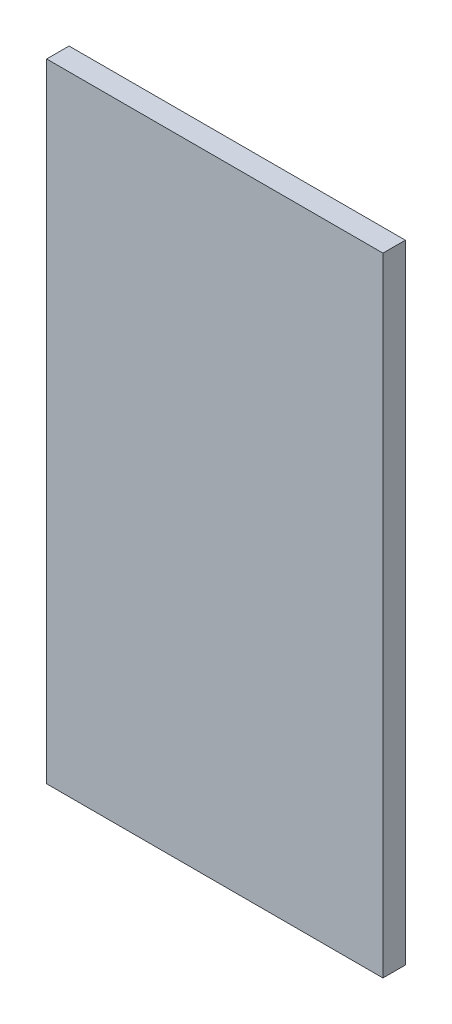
ISO-10303-21;
HEADER;
FILE_DESCRIPTION(('STEP AP214'),'2;1');
FILE_NAME('part.step','',(''),(''),'','','');
FILE_SCHEMA(('AUTOMOTIVE_DESIGN { 1 0 10303 214 1 1 1 1 }'));
ENDSEC;
DATA;
#1=APPLICATION_CONTEXT('core data for automotive mechanical design processes');
#2=APPLICATION_PROTOCOL_DEFINITION('international standard','automotive_design',2000,#1);
#3=PRODUCT_CONTEXT('',#1,'mechanical');
#4=PRODUCT('Part','Part','',(#3));
#5=PRODUCT_RELATED_PRODUCT_CATEGORY('part','',(#4));
#6=PRODUCT_DEFINITION_FORMATION('','',#4);
#7=PRODUCT_DEFINITION_CONTEXT('part definition',#1,'design');
#8=PRODUCT_DEFINITION('design','',#6,#7);
#9=PRODUCT_DEFINITION_SHAPE('','',#8);
#10=(LENGTH_UNIT() NAMED_UNIT(*) SI_UNIT(.MILLI.,.METRE.));
#11=(NAMED_UNIT(*) PLANE_ANGLE_UNIT() SI_UNIT($,.RADIAN.));
#12=(NAMED_UNIT(*) SI_UNIT($,.STERADIAN.) SOLID_ANGLE_UNIT());
#13=UNCERTAINTY_MEASURE_WITH_UNIT(LENGTH_MEASURE(1.E-05),#10,'distance_accuracy_value','');
#14=(GEOMETRIC_REPRESENTATION_CONTEXT(3) GLOBAL_UNCERTAINTY_ASSIGNED_CONTEXT((#13)) GLOBAL_UNIT_ASSIGNED_CONTEXT((#10,
#11,#12)) REPRESENTATION_CONTEXT('',''));
#15=CARTESIAN_POINT('',(0.,0.,0.));
#16=DIRECTION('',(0.,0.,1.));
#17=DIRECTION('',(1.,0.,0.));
#18=AXIS2_PLACEMENT_3D('',#15,#16,#17);
#19=CARTESIAN_POINT('',(0.,0.,12.7));
#20=DIRECTION('',(1.,0.,0.));
#21=DIRECTION('',(0.,0.,-1.));
#22=AXIS2_PLACEMENT_3D('',#19,#20,#21);
#23=PLANE('',#22);
#24=DIRECTION('',(0.,-1.,0.));
#25=VECTOR('',#24,1.);
#26=CARTESIAN_POINT('',(0.,0.,0.));
#27=LINE('',#26,#25);
#28=CARTESIAN_POINT('',(0.,355.6,0.));
#29=VERTEX_POINT('',#28);
#30=CARTESIAN_POINT('',(0.,0.,0.));
#31=VERTEX_POINT('',#30);
#32=EDGE_CURVE('E76',#29,#31,#27,.T.);
#33=ORIENTED_EDGE('',*,*,#32,.T.);
#34=DIRECTION('',(0.,0.,-1.));
#35=VECTOR('',#34,1.);
#36=CARTESIAN_POINT('',(0.,0.,12.7));
#37=LINE('',#36,#35);
#38=CARTESIAN_POINT('',(0.,0.,12.7));
#39=VERTEX_POINT('',#38);
#40=EDGE_CURVE('E11',#39,#31,#37,.T.);
#41=ORIENTED_EDGE('',*,*,#40,.F.);
#42=DIRECTION('',(0.,-1.,0.));
#43=VECTOR('',#42,1.);
#44=CARTESIAN_POINT('',(0.,0.,12.7));
#45=LINE('',#44,#43);
#46=CARTESIAN_POINT('',(0.,355.6,12.7));
#47=VERTEX_POINT('',#46);
#48=EDGE_CURVE('E94',#47,#39,#45,.T.);
#49=ORIENTED_EDGE('',*,*,#48,.F.);
#50=DIRECTION('',(0.,0.,-1.));
#51=VECTOR('',#50,1.);
#52=CARTESIAN_POINT('',(0.,355.6,12.7));
#53=LINE('',#52,#51);
#54=EDGE_CURVE('E88',#47,#29,#53,.T.);
#55=ORIENTED_EDGE('',*,*,#54,.T.);
#56=EDGE_LOOP('',(#33,#41,#49,#55));
#57=FACE_BOUND('',#56,.T.);
#58=ADVANCED_FACE('F32',(#57),#23,.F.);
#59=CARTESIAN_POINT('',(0.,0.,12.7));
#60=DIRECTION('',(0.,1.,0.));
#61=DIRECTION('',(0.,0.,1.));
#62=AXIS2_PLACEMENT_3D('',#59,#60,#61);
#63=PLANE('',#62);
#64=DIRECTION('',(1.,0.,0.));
#65=VECTOR('',#64,1.);
#66=CARTESIAN_POINT('',(0.,0.,0.));
#67=LINE('',#66,#65);
#68=CARTESIAN_POINT('',(190.5,0.,0.));
#69=VERTEX_POINT('',#68);
#70=EDGE_CURVE('E72',#31,#69,#67,.T.);
#71=ORIENTED_EDGE('',*,*,#70,.T.);
#72=DIRECTION('',(0.,0.,-1.));
#73=VECTOR('',#72,1.);
#74=CARTESIAN_POINT('',(190.5,0.,12.7));
#75=LINE('',#74,#73);
#76=CARTESIAN_POINT('',(190.5,0.,12.7));
#77=VERTEX_POINT('',#76);
#78=EDGE_CURVE('E39',#77,#69,#75,.T.);
#79=ORIENTED_EDGE('',*,*,#78,.F.);
#80=DIRECTION('',(1.,0.,0.));
#81=VECTOR('',#80,1.);
#82=CARTESIAN_POINT('',(0.,0.,12.7));
#83=LINE('',#82,#81);
#84=EDGE_CURVE('E84',#39,#77,#83,.T.);
#85=ORIENTED_EDGE('',*,*,#84,.F.);
#86=ORIENTED_EDGE('',*,*,#40,.T.);
#87=EDGE_LOOP('',(#71,#79,#85,#86));
#88=FACE_BOUND('',#87,.T.);
#89=ADVANCED_FACE('F83',(#88),#63,.F.);
#90=CARTESIAN_POINT('',(190.5,0.,12.7));
#91=DIRECTION('',(-1.,0.,0.));
#92=DIRECTION('',(0.,0.,1.));
#93=AXIS2_PLACEMENT_3D('',#90,#91,#92);
#94=PLANE('',#93);
#95=DIRECTION('',(0.,1.,0.));
#96=VECTOR('',#95,1.);
#97=CARTESIAN_POINT('',(190.5,0.,0.));
#98=LINE('',#97,#96);
#99=CARTESIAN_POINT('',(190.5,355.6,0.));
#100=VERTEX_POINT('',#99);
#101=EDGE_CURVE('E77',#69,#100,#98,.T.);
#102=ORIENTED_EDGE('',*,*,#101,.T.);
#103=DIRECTION('',(0.,0.,-1.));
#104=VECTOR('',#103,1.);
#105=CARTESIAN_POINT('',(190.5,355.6,12.7));
#106=LINE('',#105,#104);
#107=CARTESIAN_POINT('',(190.5,355.6,12.7));
#108=VERTEX_POINT('',#107);
#109=EDGE_CURVE('E100',#108,#100,#106,.T.);
#110=ORIENTED_EDGE('',*,*,#109,.F.);
#111=DIRECTION('',(0.,1.,0.));
#112=VECTOR('',#111,1.);
#113=CARTESIAN_POINT('',(190.5,0.,12.7));
#114=LINE('',#113,#112);
#115=EDGE_CURVE('E51',#77,#108,#114,.T.);
#116=ORIENTED_EDGE('',*,*,#115,.F.);
#117=ORIENTED_EDGE('',*,*,#78,.T.);
#118=EDGE_LOOP('',(#102,#110,#116,#117));
#119=FACE_BOUND('',#118,.T.);
#120=ADVANCED_FACE('F103',(#119),#94,.F.);
#121=CARTESIAN_POINT('',(0.,355.6,12.7));
#122=DIRECTION('',(0.,-1.,0.));
#123=DIRECTION('',(0.,0.,-1.));
#124=AXIS2_PLACEMENT_3D('',#121,#122,#123);
#125=PLANE('',#124);
#126=DIRECTION('',(-1.,0.,0.));
#127=VECTOR('',#126,1.);
#128=CARTESIAN_POINT('',(0.,355.6,0.));
#129=LINE('',#128,#127);
#130=EDGE_CURVE('E92',#100,#29,#129,.T.);
#131=ORIENTED_EDGE('',*,*,#130,.T.);
#132=ORIENTED_EDGE('',*,*,#54,.F.);
#133=DIRECTION('',(-1.,0.,0.));
#134=VECTOR('',#133,1.);
#135=CARTESIAN_POINT('',(0.,355.6,12.7));
#136=LINE('',#135,#134);
#137=EDGE_CURVE('E46',#108,#47,#136,.T.);
#138=ORIENTED_EDGE('',*,*,#137,.F.);
#139=ORIENTED_EDGE('',*,*,#109,.T.);
#140=EDGE_LOOP('',(#131,#132,#138,#139));
#141=FACE_BOUND('',#140,.T.);
#142=ADVANCED_FACE('F105',(#141),#125,.F.);
#143=CARTESIAN_POINT('',(0.,355.6,12.7));
#144=DIRECTION('',(0.,0.,-1.));
#145=DIRECTION('',(-1.,0.,0.));
#146=AXIS2_PLACEMENT_3D('',#143,#144,#145);
#147=PLANE('',#146);
#148=ORIENTED_EDGE('',*,*,#48,.T.);
#149=ORIENTED_EDGE('',*,*,#84,.T.);
#150=ORIENTED_EDGE('',*,*,#115,.T.);
#151=ORIENTED_EDGE('',*,*,#137,.T.);
#152=EDGE_LOOP('',(#148,#149,#150,#151));
#153=FACE_BOUND('',#152,.T.);
#154=ADVANCED_FACE('F106',(#153),#147,.F.);
#155=CARTESIAN_POINT('',(0.,355.6,0.));
#156=DIRECTION('',(0.,0.,-1.));
#157=DIRECTION('',(-1.,0.,0.));
#158=AXIS2_PLACEMENT_3D('',#155,#156,#157);
#159=PLANE('',#158);
#160=ORIENTED_EDGE('',*,*,#32,.F.);
#161=ORIENTED_EDGE('',*,*,#130,.F.);
#162=ORIENTED_EDGE('',*,*,#101,.F.);
#163=ORIENTED_EDGE('',*,*,#70,.F.);
#164=EDGE_LOOP('',(#160,#161,#162,#163));
#165=FACE_BOUND('',#164,.T.);
#166=ADVANCED_FACE('F73',(#165),#159,.T.);
#167=CLOSED_SHELL('',(#58,#89,#120,#142,#154,#166));
#168=MANIFOLD_SOLID_BREP('B2',#167);
#169=ADVANCED_BREP_SHAPE_REPRESENTATION('',(#18,#168),#14);
#170=SHAPE_DEFINITION_REPRESENTATION(#9,#169);
ENDSEC;
END-ISO-10303-21;
